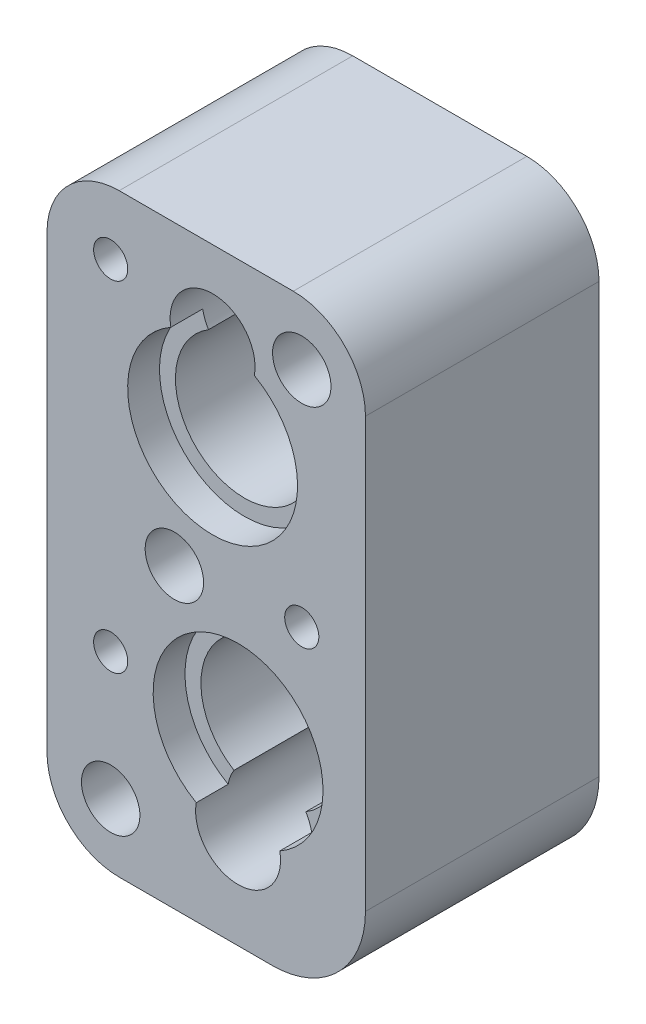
ISO-10303-21;
HEADER;
FILE_DESCRIPTION(('STEP AP214'),'2;1');
FILE_NAME('part.step','',(''),(''),'','','');
FILE_SCHEMA(('AUTOMOTIVE_DESIGN { 1 0 10303 214 1 1 1 1 }'));
ENDSEC;
DATA;
#1=APPLICATION_CONTEXT('core data for automotive mechanical design processes');
#2=APPLICATION_PROTOCOL_DEFINITION('international standard','automotive_design',2000,#1);
#3=PRODUCT_CONTEXT('',#1,'mechanical');
#4=PRODUCT('Part','Part','',(#3));
#5=PRODUCT_RELATED_PRODUCT_CATEGORY('part','',(#4));
#6=PRODUCT_DEFINITION_FORMATION('','',#4);
#7=PRODUCT_DEFINITION_CONTEXT('part definition',#1,'design');
#8=PRODUCT_DEFINITION('design','',#6,#7);
#9=PRODUCT_DEFINITION_SHAPE('','',#8);
#10=(LENGTH_UNIT() NAMED_UNIT(*) SI_UNIT(.MILLI.,.METRE.));
#11=(NAMED_UNIT(*) PLANE_ANGLE_UNIT() SI_UNIT($,.RADIAN.));
#12=(NAMED_UNIT(*) SI_UNIT($,.STERADIAN.) SOLID_ANGLE_UNIT());
#13=UNCERTAINTY_MEASURE_WITH_UNIT(LENGTH_MEASURE(1.E-05),#10,'distance_accuracy_value','');
#14=(GEOMETRIC_REPRESENTATION_CONTEXT(3) GLOBAL_UNCERTAINTY_ASSIGNED_CONTEXT((#13)) GLOBAL_UNIT_ASSIGNED_CONTEXT((#10,
#11,#12)) REPRESENTATION_CONTEXT('',''));
#15=CARTESIAN_POINT('',(0.,0.,0.));
#16=DIRECTION('',(0.,0.,1.));
#17=DIRECTION('',(1.,0.,0.));
#18=AXIS2_PLACEMENT_3D('',#15,#16,#17);
#19=CARTESIAN_POINT('',(-147.955,77.8002,37.0332));
#20=DIRECTION('',(0.,0.,1.));
#21=DIRECTION('',(0.,-1.,0.));
#22=AXIS2_PLACEMENT_3D('',#19,#20,#21);
#23=CYLINDRICAL_SURFACE('',#22,10.795);
#24=DIRECTION('',(0.,0.,1.));
#25=VECTOR('',#24,1.);
#26=CARTESIAN_POINT('',(-158.75,77.8002,37.0332));
#27=LINE('',#26,#25);
#28=CARTESIAN_POINT('',(-158.75,77.8002,37.0332));
#29=VERTEX_POINT('',#28);
#30=CARTESIAN_POINT('',(-158.75,77.8002,71.9582));
#31=VERTEX_POINT('',#30);
#32=EDGE_CURVE('E443',#29,#31,#27,.T.);
#33=ORIENTED_EDGE('',*,*,#32,.T.);
#34=CARTESIAN_POINT('',(-147.955,77.8002,71.9582));
#35=DIRECTION('',(0.,0.,-1.));
#36=DIRECTION('',(0.,-1.,0.));
#37=AXIS2_PLACEMENT_3D('',#34,#35,#36);
#38=CIRCLE('',#37,10.795);
#39=CARTESIAN_POINT('',(-147.955,88.5952,71.9582));
#40=VERTEX_POINT('',#39);
#41=EDGE_CURVE('E190',#31,#40,#38,.T.);
#42=ORIENTED_EDGE('',*,*,#41,.T.);
#43=DIRECTION('',(0.,0.,1.));
#44=VECTOR('',#43,1.);
#45=CARTESIAN_POINT('',(-147.955,88.5952,37.0332));
#46=LINE('',#45,#44);
#47=CARTESIAN_POINT('',(-147.955,88.5952,37.0332));
#48=VERTEX_POINT('',#47);
#49=EDGE_CURVE('E507',#48,#40,#46,.T.);
#50=ORIENTED_EDGE('',*,*,#49,.F.);
#51=CARTESIAN_POINT('',(-147.955,77.8002,37.0332));
#52=DIRECTION('',(0.,0.,-1.));
#53=DIRECTION('',(0.,-1.,0.));
#54=AXIS2_PLACEMENT_3D('',#51,#52,#53);
#55=CIRCLE('',#54,10.795);
#56=EDGE_CURVE('E449',#29,#48,#55,.T.);
#57=ORIENTED_EDGE('',*,*,#56,.F.);
#58=EDGE_LOOP('',(#33,#42,#50,#57));
#59=FACE_BOUND('',#58,.T.);
#60=ADVANCED_FACE('F54',(#59),#23,.T.);
#61=CARTESIAN_POINT('',(-121.92,88.5952,37.0332));
#62=DIRECTION('',(0.,-1.,0.));
#63=DIRECTION('',(0.,0.,-1.));
#64=AXIS2_PLACEMENT_3D('',#61,#62,#63);
#65=PLANE('',#64);
#66=ORIENTED_EDGE('',*,*,#49,.T.);
#67=DIRECTION('',(1.,0.,0.));
#68=VECTOR('',#67,1.);
#69=CARTESIAN_POINT('',(-121.92,88.5952,71.9582));
#70=LINE('',#69,#68);
#71=CARTESIAN_POINT('',(-121.92,88.5952,71.9582));
#72=VERTEX_POINT('',#71);
#73=EDGE_CURVE('E197',#40,#72,#70,.T.);
#74=ORIENTED_EDGE('',*,*,#73,.T.);
#75=DIRECTION('',(0.,0.,1.));
#76=VECTOR('',#75,1.);
#77=CARTESIAN_POINT('',(-121.92,88.5952,37.0332));
#78=LINE('',#77,#76);
#79=CARTESIAN_POINT('',(-121.92,88.5952,37.0332));
#80=VERTEX_POINT('',#79);
#81=EDGE_CURVE('E503',#80,#72,#78,.T.);
#82=ORIENTED_EDGE('',*,*,#81,.F.);
#83=DIRECTION('',(1.,0.,0.));
#84=VECTOR('',#83,1.);
#85=CARTESIAN_POINT('',(-121.92,88.5952,37.0332));
#86=LINE('',#85,#84);
#87=EDGE_CURVE('E456',#48,#80,#86,.T.);
#88=ORIENTED_EDGE('',*,*,#87,.F.);
#89=EDGE_LOOP('',(#66,#74,#82,#88));
#90=FACE_BOUND('',#89,.T.);
#91=ADVANCED_FACE('F537',(#90),#65,.F.);
#92=CARTESIAN_POINT('',(-121.92,77.8002,37.0332));
#93=DIRECTION('',(0.,0.,1.));
#94=DIRECTION('',(0.,-1.,0.));
#95=AXIS2_PLACEMENT_3D('',#92,#93,#94);
#96=CYLINDRICAL_SURFACE('',#95,10.795);
#97=ORIENTED_EDGE('',*,*,#81,.T.);
#98=CARTESIAN_POINT('',(-121.92,77.8002,71.9582));
#99=DIRECTION('',(0.,0.,-1.));
#100=DIRECTION('',(0.,1.,0.));
#101=AXIS2_PLACEMENT_3D('',#98,#99,#100);
#102=CIRCLE('',#101,10.795);
#103=CARTESIAN_POINT('',(-111.125,77.8002,71.9582));
#104=VERTEX_POINT('',#103);
#105=EDGE_CURVE('E476',#72,#104,#102,.T.);
#106=ORIENTED_EDGE('',*,*,#105,.T.);
#107=DIRECTION('',(0.,0.,1.));
#108=VECTOR('',#107,1.);
#109=CARTESIAN_POINT('',(-111.125,77.8002,37.0332));
#110=LINE('',#109,#108);
#111=CARTESIAN_POINT('',(-111.125,77.8002,37.0332));
#112=VERTEX_POINT('',#111);
#113=EDGE_CURVE('E500',#112,#104,#110,.T.);
#114=ORIENTED_EDGE('',*,*,#113,.F.);
#115=CARTESIAN_POINT('',(-121.92,77.8002,37.0332));
#116=DIRECTION('',(0.,0.,-1.));
#117=DIRECTION('',(0.,1.,0.));
#118=AXIS2_PLACEMENT_3D('',#115,#116,#117);
#119=CIRCLE('',#118,10.795);
#120=EDGE_CURVE('E529',#80,#112,#119,.T.);
#121=ORIENTED_EDGE('',*,*,#120,.F.);
#122=EDGE_LOOP('',(#97,#106,#114,#121));
#123=FACE_BOUND('',#122,.T.);
#124=ADVANCED_FACE('F540',(#123),#96,.T.);
#125=CARTESIAN_POINT('',(-111.125,77.8002,37.0332));
#126=DIRECTION('',(-1.,0.,0.));
#127=DIRECTION('',(0.,-1.,0.));
#128=AXIS2_PLACEMENT_3D('',#125,#126,#127);
#129=PLANE('',#128);
#130=ORIENTED_EDGE('',*,*,#113,.T.);
#131=DIRECTION('',(0.,-1.,0.));
#132=VECTOR('',#131,1.);
#133=CARTESIAN_POINT('',(-111.125,77.8002,71.9582));
#134=LINE('',#133,#132);
#135=CARTESIAN_POINT('',(-111.125,13.6652,71.9582));
#136=VERTEX_POINT('',#135);
#137=EDGE_CURVE('E469',#104,#136,#134,.T.);
#138=ORIENTED_EDGE('',*,*,#137,.T.);
#139=DIRECTION('',(0.,0.,1.));
#140=VECTOR('',#139,1.);
#141=CARTESIAN_POINT('',(-111.125,13.6652,37.0332));
#142=LINE('',#141,#140);
#143=CARTESIAN_POINT('',(-111.125,13.6652,37.0332));
#144=VERTEX_POINT('',#143);
#145=EDGE_CURVE('E496',#144,#136,#142,.T.);
#146=ORIENTED_EDGE('',*,*,#145,.F.);
#147=DIRECTION('',(0.,-1.,0.));
#148=VECTOR('',#147,1.);
#149=CARTESIAN_POINT('',(-111.125,77.8002,37.0332));
#150=LINE('',#149,#148);
#151=EDGE_CURVE('E526',#112,#144,#150,.T.);
#152=ORIENTED_EDGE('',*,*,#151,.F.);
#153=EDGE_LOOP('',(#130,#138,#146,#152));
#154=FACE_BOUND('',#153,.T.);
#155=ADVANCED_FACE('F545',(#154),#129,.F.);
#156=CARTESIAN_POINT('',(-125.095,13.6652,37.0332));
#157=DIRECTION('',(0.,0.,1.));
#158=DIRECTION('',(0.,-1.,0.));
#159=AXIS2_PLACEMENT_3D('',#156,#157,#158);
#160=CYLINDRICAL_SURFACE('',#159,13.97);
#161=ORIENTED_EDGE('',*,*,#145,.T.);
#162=CARTESIAN_POINT('',(-125.095,13.6652,71.9582));
#163=DIRECTION('',(0.,0.,-1.));
#164=DIRECTION('',(0.,1.,0.));
#165=AXIS2_PLACEMENT_3D('',#162,#163,#164);
#166=CIRCLE('',#165,13.97);
#167=CARTESIAN_POINT('',(-125.095,-0.304799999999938,71.9582));
#168=VERTEX_POINT('',#167);
#169=EDGE_CURVE('E475',#136,#168,#166,.T.);
#170=ORIENTED_EDGE('',*,*,#169,.T.);
#171=DIRECTION('',(0.,0.,1.));
#172=VECTOR('',#171,1.);
#173=CARTESIAN_POINT('',(-125.095,-0.304799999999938,37.0332));
#174=LINE('',#173,#172);
#175=CARTESIAN_POINT('',(-125.095,-0.304799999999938,37.0332));
#176=VERTEX_POINT('',#175);
#177=EDGE_CURVE('E493',#176,#168,#174,.T.);
#178=ORIENTED_EDGE('',*,*,#177,.F.);
#179=CARTESIAN_POINT('',(-125.095,13.6652,37.0332));
#180=DIRECTION('',(0.,0.,-1.));
#181=DIRECTION('',(0.,1.,0.));
#182=AXIS2_PLACEMENT_3D('',#179,#180,#181);
#183=CIRCLE('',#182,13.97);
#184=EDGE_CURVE('E523',#144,#176,#183,.T.);
#185=ORIENTED_EDGE('',*,*,#184,.F.);
#186=EDGE_LOOP('',(#161,#170,#178,#185));
#187=FACE_BOUND('',#186,.T.);
#188=ADVANCED_FACE('F551',(#187),#160,.T.);
#189=CARTESIAN_POINT('',(-125.095,-0.304799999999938,37.0332));
#190=DIRECTION('',(0.,1.,0.));
#191=DIRECTION('',(0.,0.,1.));
#192=AXIS2_PLACEMENT_3D('',#189,#190,#191);
#193=PLANE('',#192);
#194=ORIENTED_EDGE('',*,*,#177,.T.);
#195=DIRECTION('',(-1.,0.,0.));
#196=VECTOR('',#195,1.);
#197=CARTESIAN_POINT('',(-125.095,-0.304799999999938,71.9582));
#198=LINE('',#197,#196);
#199=CARTESIAN_POINT('',(-147.955,-0.304799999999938,71.9582));
#200=VERTEX_POINT('',#199);
#201=EDGE_CURVE('E458',#168,#200,#198,.T.);
#202=ORIENTED_EDGE('',*,*,#201,.T.);
#203=DIRECTION('',(0.,0.,1.));
#204=VECTOR('',#203,1.);
#205=CARTESIAN_POINT('',(-147.955,-0.304799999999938,37.0332));
#206=LINE('',#205,#204);
#207=CARTESIAN_POINT('',(-147.955,-0.304799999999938,37.0332));
#208=VERTEX_POINT('',#207);
#209=EDGE_CURVE('E488',#208,#200,#206,.T.);
#210=ORIENTED_EDGE('',*,*,#209,.F.);
#211=DIRECTION('',(-1.,0.,0.));
#212=VECTOR('',#211,1.);
#213=CARTESIAN_POINT('',(-125.095,-0.304799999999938,37.0332));
#214=LINE('',#213,#212);
#215=EDGE_CURVE('E520',#176,#208,#214,.T.);
#216=ORIENTED_EDGE('',*,*,#215,.F.);
#217=EDGE_LOOP('',(#194,#202,#210,#216));
#218=FACE_BOUND('',#217,.T.);
#219=ADVANCED_FACE('F556',(#218),#193,.F.);
#220=CARTESIAN_POINT('',(-147.955,10.4902000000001,37.0332));
#221=DIRECTION('',(0.,0.,1.));
#222=DIRECTION('',(0.,-1.,0.));
#223=AXIS2_PLACEMENT_3D('',#220,#221,#222);
#224=CYLINDRICAL_SURFACE('',#223,10.795);
#225=ORIENTED_EDGE('',*,*,#209,.T.);
#226=CARTESIAN_POINT('',(-147.955,10.4902000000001,71.9582));
#227=DIRECTION('',(0.,0.,-1.));
#228=DIRECTION('',(0.,1.,0.));
#229=AXIS2_PLACEMENT_3D('',#226,#227,#228);
#230=CIRCLE('',#229,10.795);
#231=CARTESIAN_POINT('',(-158.75,10.4902000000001,71.9582));
#232=VERTEX_POINT('',#231);
#233=EDGE_CURVE('E450',#200,#232,#230,.T.);
#234=ORIENTED_EDGE('',*,*,#233,.T.);
#235=DIRECTION('',(0.,0.,1.));
#236=VECTOR('',#235,1.);
#237=CARTESIAN_POINT('',(-158.75,10.4902000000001,37.0332));
#238=LINE('',#237,#236);
#239=CARTESIAN_POINT('',(-158.75,10.4902000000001,37.0332));
#240=VERTEX_POINT('',#239);
#241=EDGE_CURVE('E446',#240,#232,#238,.T.);
#242=ORIENTED_EDGE('',*,*,#241,.F.);
#243=CARTESIAN_POINT('',(-147.955,10.4902000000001,37.0332));
#244=DIRECTION('',(0.,0.,-1.));
#245=DIRECTION('',(0.,1.,0.));
#246=AXIS2_PLACEMENT_3D('',#243,#244,#245);
#247=CIRCLE('',#246,10.795);
#248=EDGE_CURVE('E517',#208,#240,#247,.T.);
#249=ORIENTED_EDGE('',*,*,#248,.F.);
#250=EDGE_LOOP('',(#225,#234,#242,#249));
#251=FACE_BOUND('',#250,.T.);
#252=ADVANCED_FACE('F559',(#251),#224,.T.);
#253=CARTESIAN_POINT('',(-158.75,77.8002,37.0332));
#254=DIRECTION('',(1.,0.,0.));
#255=DIRECTION('',(0.,0.,-1.));
#256=AXIS2_PLACEMENT_3D('',#253,#254,#255);
#257=PLANE('',#256);
#258=ORIENTED_EDGE('',*,*,#241,.T.);
#259=DIRECTION('',(0.,1.,0.));
#260=VECTOR('',#259,1.);
#261=CARTESIAN_POINT('',(-158.75,77.8002,71.9582));
#262=LINE('',#261,#260);
#263=EDGE_CURVE('E434',#232,#31,#262,.T.);
#264=ORIENTED_EDGE('',*,*,#263,.T.);
#265=ORIENTED_EDGE('',*,*,#32,.F.);
#266=DIRECTION('',(0.,1.,0.));
#267=VECTOR('',#266,1.);
#268=CARTESIAN_POINT('',(-158.75,77.8002,37.0332));
#269=LINE('',#268,#267);
#270=EDGE_CURVE('E514',#240,#29,#269,.T.);
#271=ORIENTED_EDGE('',*,*,#270,.F.);
#272=EDGE_LOOP('',(#258,#264,#265,#271));
#273=FACE_BOUND('',#272,.T.);
#274=ADVANCED_FACE('F441',(#273),#257,.F.);
#275=CARTESIAN_POINT('',(-147.955,77.8002,37.0332));
#276=DIRECTION('',(0.,0.,1.));
#277=DIRECTION('',(0.,-1.,0.));
#278=AXIS2_PLACEMENT_3D('',#275,#276,#277);
#279=PLANE('',#278);
#280=CARTESIAN_POINT('',(-120.65,79.0702,37.0332));
#281=DIRECTION('',(0.,0.,-1.));
#282=DIRECTION('',(0.,1.,0.));
#283=AXIS2_PLACEMENT_3D('',#280,#281,#282);
#284=CIRCLE('',#283,6.54050000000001);
#285=CARTESIAN_POINT('',(-120.65,85.6107,37.0332));
#286=VERTEX_POINT('',#285);
#287=EDGE_CURVE('E332',#286,#286,#284,.T.);
#288=ORIENTED_EDGE('',*,*,#287,.F.);
#289=EDGE_LOOP('',(#288));
#290=FACE_BOUND('',#289,.T.);
#291=CARTESIAN_POINT('',(-139.7,44.1452000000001,37.0332));
#292=DIRECTION('',(0.,0.,-1.));
#293=DIRECTION('',(0.,1.,0.));
#294=AXIS2_PLACEMENT_3D('',#291,#292,#293);
#295=CIRCLE('',#294,6.54050000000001);
#296=CARTESIAN_POINT('',(-139.7,50.6857000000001,37.0332));
#297=VERTEX_POINT('',#296);
#298=EDGE_CURVE('E371',#297,#297,#295,.T.);
#299=ORIENTED_EDGE('',*,*,#298,.F.);
#300=EDGE_LOOP('',(#299));
#301=FACE_BOUND('',#300,.T.);
#302=CARTESIAN_POINT('',(-149.225,9.22020000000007,37.0332));
#303=DIRECTION('',(0.,0.,-1.));
#304=DIRECTION('',(0.,1.,0.));
#305=AXIS2_PLACEMENT_3D('',#302,#303,#304);
#306=CIRCLE('',#305,6.54050000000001);
#307=CARTESIAN_POINT('',(-149.225,15.7607000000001,37.0332));
#308=VERTEX_POINT('',#307);
#309=EDGE_CURVE('E390',#308,#308,#306,.T.);
#310=ORIENTED_EDGE('',*,*,#309,.F.);
#311=EDGE_LOOP('',(#310));
#312=FACE_BOUND('',#311,.T.);
#313=CARTESIAN_POINT('',(-149.225,28.2702000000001,37.0331999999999));
#314=DIRECTION('',(0.,0.,1.));
#315=DIRECTION('',(1.,0.,0.));
#316=AXIS2_PLACEMENT_3D('',#313,#314,#315);
#317=CIRCLE('',#316,2.55269999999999);
#318=CARTESIAN_POINT('',(-146.6723,28.2702000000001,37.0331999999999));
#319=VERTEX_POINT('',#318);
#320=EDGE_CURVE('E315',#319,#319,#317,.T.);
#321=ORIENTED_EDGE('',*,*,#320,.T.);
#322=EDGE_LOOP('',(#321));
#323=FACE_BOUND('',#322,.T.);
#324=CARTESIAN_POINT('',(-120.65,45.7327,37.0331999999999));
#325=DIRECTION('',(0.,0.,1.));
#326=DIRECTION('',(1.,0.,0.));
#327=AXIS2_PLACEMENT_3D('',#324,#325,#326);
#328=CIRCLE('',#327,2.55269999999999);
#329=CARTESIAN_POINT('',(-118.0973,45.7327,37.0331999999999));
#330=VERTEX_POINT('',#329);
#331=EDGE_CURVE('E300',#330,#330,#328,.T.);
#332=ORIENTED_EDGE('',*,*,#331,.T.);
#333=EDGE_LOOP('',(#332));
#334=FACE_BOUND('',#333,.T.);
#335=CARTESIAN_POINT('',(-149.225,79.0702,37.0331999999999));
#336=DIRECTION('',(0.,0.,1.));
#337=DIRECTION('',(1.,0.,0.));
#338=AXIS2_PLACEMENT_3D('',#335,#336,#337);
#339=CIRCLE('',#338,2.55269999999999);
#340=CARTESIAN_POINT('',(-146.6723,79.0702,37.0331999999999));
#341=VERTEX_POINT('',#340);
#342=EDGE_CURVE('E267',#341,#341,#339,.T.);
#343=ORIENTED_EDGE('',*,*,#342,.T.);
#344=EDGE_LOOP('',(#343));
#345=FACE_BOUND('',#344,.T.);
#346=CARTESIAN_POINT('',(-133.985,75.8952,37.0332));
#347=DIRECTION('',(0.,0.,-1.));
#348=DIRECTION('',(0.,1.,0.));
#349=AXIS2_PLACEMENT_3D('',#346,#347,#348);
#350=CIRCLE('',#349,6.34999999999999);
#351=CARTESIAN_POINT('',(-139.35881585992,72.5122126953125,37.0332));
#352=VERTEX_POINT('',#351);
#353=CARTESIAN_POINT('',(-128.61118414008,72.5122126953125,37.0332));
#354=VERTEX_POINT('',#353);
#355=EDGE_CURVE('E200',#352,#354,#350,.T.);
#356=ORIENTED_EDGE('',*,*,#355,.F.);
#357=CARTESIAN_POINT('',(-133.985,63.7032,37.0332));
#358=DIRECTION('',(0.,0.,1.));
#359=DIRECTION('',(1.,0.,0.));
#360=AXIS2_PLACEMENT_3D('',#357,#358,#359);
#361=CIRCLE('',#360,10.31875);
#362=EDGE_CURVE('E175',#352,#354,#361,.T.);
#363=ORIENTED_EDGE('',*,*,#362,.T.);
#364=EDGE_LOOP('',(#356,#363));
#365=FACE_BOUND('',#364,.T.);
#366=CARTESIAN_POINT('',(-130.175,13.97,37.0332));
#367=DIRECTION('',(0.,0.,-1.));
#368=DIRECTION('',(0.,1.,0.));
#369=AXIS2_PLACEMENT_3D('',#366,#367,#368);
#370=CIRCLE('',#369,6.34999999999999);
#371=CARTESIAN_POINT('',(-124.80118414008,17.3529873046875,37.0331999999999));
#372=VERTEX_POINT('',#371);
#373=CARTESIAN_POINT('',(-135.54881585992,17.3529873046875,37.0331999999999));
#374=VERTEX_POINT('',#373);
#375=EDGE_CURVE('E181',#372,#374,#370,.T.);
#376=ORIENTED_EDGE('',*,*,#375,.F.);
#377=CARTESIAN_POINT('',(-130.175,26.162,37.0331999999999));
#378=DIRECTION('',(0.,0.,1.));
#379=DIRECTION('',(1.,0.,0.));
#380=AXIS2_PLACEMENT_3D('',#377,#378,#379);
#381=CIRCLE('',#380,10.31875);
#382=EDGE_CURVE('E168',#372,#374,#381,.T.);
#383=ORIENTED_EDGE('',*,*,#382,.T.);
#384=EDGE_LOOP('',(#376,#383));
#385=FACE_BOUND('',#384,.T.);
#386=ORIENTED_EDGE('',*,*,#56,.T.);
#387=ORIENTED_EDGE('',*,*,#87,.T.);
#388=ORIENTED_EDGE('',*,*,#120,.T.);
#389=ORIENTED_EDGE('',*,*,#151,.T.);
#390=ORIENTED_EDGE('',*,*,#184,.T.);
#391=ORIENTED_EDGE('',*,*,#215,.T.);
#392=ORIENTED_EDGE('',*,*,#248,.T.);
#393=ORIENTED_EDGE('',*,*,#270,.T.);
#394=EDGE_LOOP('',(#386,#387,#388,#389,#390,#391,#392,#393));
#395=FACE_BOUND('',#394,.T.);
#396=ADVANCED_FACE('F179',(#290,#301,#312,#323,#334,#345,#365,#385,#395),#279,.F.);
#397=CARTESIAN_POINT('',(-147.955,77.8002,71.9582));
#398=DIRECTION('',(0.,0.,1.));
#399=DIRECTION('',(0.,-1.,0.));
#400=AXIS2_PLACEMENT_3D('',#397,#398,#399);
#401=PLANE('',#400);
#402=CARTESIAN_POINT('',(-120.65,79.0702,71.9582));
#403=DIRECTION('',(0.,0.,-1.));
#404=DIRECTION('',(0.,1.,0.));
#405=AXIS2_PLACEMENT_3D('',#402,#403,#404);
#406=CIRCLE('',#405,4.36879999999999);
#407=CARTESIAN_POINT('',(-120.65,83.439,71.9582));
#408=VERTEX_POINT('',#407);
#409=EDGE_CURVE('E750',#408,#408,#406,.T.);
#410=ORIENTED_EDGE('',*,*,#409,.T.);
#411=EDGE_LOOP('',(#410));
#412=FACE_BOUND('',#411,.T.);
#413=CARTESIAN_POINT('',(-139.7,44.1452000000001,71.9582));
#414=DIRECTION('',(0.,0.,-1.));
#415=DIRECTION('',(0.,1.,0.));
#416=AXIS2_PLACEMENT_3D('',#413,#414,#415);
#417=CIRCLE('',#416,4.36879999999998);
#418=CARTESIAN_POINT('',(-139.7,48.514,71.9582));
#419=VERTEX_POINT('',#418);
#420=EDGE_CURVE('E325',#419,#419,#417,.T.);
#421=ORIENTED_EDGE('',*,*,#420,.T.);
#422=EDGE_LOOP('',(#421));
#423=FACE_BOUND('',#422,.T.);
#424=CARTESIAN_POINT('',(-149.225,9.22020000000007,71.9582));
#425=DIRECTION('',(0.,0.,-1.));
#426=DIRECTION('',(0.,1.,0.));
#427=AXIS2_PLACEMENT_3D('',#424,#425,#426);
#428=CIRCLE('',#427,4.36879999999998);
#429=CARTESIAN_POINT('',(-149.225,13.589,71.9582));
#430=VERTEX_POINT('',#429);
#431=EDGE_CURVE('E365',#430,#430,#428,.T.);
#432=ORIENTED_EDGE('',*,*,#431,.T.);
#433=EDGE_LOOP('',(#432));
#434=FACE_BOUND('',#433,.T.);
#435=CARTESIAN_POINT('',(-149.225,28.2702000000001,71.9582));
#436=DIRECTION('',(0.,0.,1.));
#437=DIRECTION('',(1.,0.,0.));
#438=AXIS2_PLACEMENT_3D('',#435,#436,#437);
#439=CIRCLE('',#438,2.55269999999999);
#440=CARTESIAN_POINT('',(-146.6723,28.2702000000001,71.9582));
#441=VERTEX_POINT('',#440);
#442=EDGE_CURVE('E310',#441,#441,#439,.T.);
#443=ORIENTED_EDGE('',*,*,#442,.F.);
#444=EDGE_LOOP('',(#443));
#445=FACE_BOUND('',#444,.T.);
#446=CARTESIAN_POINT('',(-120.65,45.7327,71.9582));
#447=DIRECTION('',(0.,0.,1.));
#448=DIRECTION('',(1.,0.,0.));
#449=AXIS2_PLACEMENT_3D('',#446,#447,#448);
#450=CIRCLE('',#449,2.55270000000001);
#451=CARTESIAN_POINT('',(-118.0973,45.7327,71.9582));
#452=VERTEX_POINT('',#451);
#453=EDGE_CURVE('E295',#452,#452,#450,.T.);
#454=ORIENTED_EDGE('',*,*,#453,.F.);
#455=EDGE_LOOP('',(#454));
#456=FACE_BOUND('',#455,.T.);
#457=CARTESIAN_POINT('',(-149.225,79.0702,71.9582));
#458=DIRECTION('',(0.,0.,1.));
#459=DIRECTION('',(1.,0.,0.));
#460=AXIS2_PLACEMENT_3D('',#457,#458,#459);
#461=CIRCLE('',#460,2.55269999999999);
#462=CARTESIAN_POINT('',(-146.6723,79.0702,71.9582));
#463=VERTEX_POINT('',#462);
#464=EDGE_CURVE('E183',#463,#463,#461,.T.);
#465=ORIENTED_EDGE('',*,*,#464,.F.);
#466=EDGE_LOOP('',(#465));
#467=FACE_BOUND('',#466,.T.);
#468=CARTESIAN_POINT('',(-130.175,26.162,71.9582));
#469=DIRECTION('',(0.,0.,1.));
#470=DIRECTION('',(0.,-1.,0.));
#471=AXIS2_PLACEMENT_3D('',#468,#469,#470);
#472=CIRCLE('',#471,12.7);
#473=CARTESIAN_POINT('',(-123.927269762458,15.1050625,71.9582));
#474=VERTEX_POINT('',#473);
#475=CARTESIAN_POINT('',(-136.422730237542,15.1050625,71.9582));
#476=VERTEX_POINT('',#475);
#477=EDGE_CURVE('E12',#474,#476,#472,.T.);
#478=ORIENTED_EDGE('',*,*,#477,.F.);
#479=CARTESIAN_POINT('',(-130.175,13.97,71.9582));
#480=DIRECTION('',(0.,0.,-1.));
#481=DIRECTION('',(0.,1.,0.));
#482=AXIS2_PLACEMENT_3D('',#479,#480,#481);
#483=CIRCLE('',#482,6.34999999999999);
#484=EDGE_CURVE('E191',#474,#476,#483,.T.);
#485=ORIENTED_EDGE('',*,*,#484,.T.);
#486=EDGE_LOOP('',(#478,#485));
#487=FACE_BOUND('',#486,.T.);
#488=CARTESIAN_POINT('',(-133.985,63.7032,71.9582));
#489=DIRECTION('',(0.,0.,1.));
#490=DIRECTION('',(1.,0.,0.));
#491=AXIS2_PLACEMENT_3D('',#488,#489,#490);
#492=CIRCLE('',#491,12.7);
#493=CARTESIAN_POINT('',(-140.232730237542,74.7601375,71.9582));
#494=VERTEX_POINT('',#493);
#495=CARTESIAN_POINT('',(-127.737269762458,74.7601375,71.9582));
#496=VERTEX_POINT('',#495);
#497=EDGE_CURVE('E78',#494,#496,#492,.T.);
#498=ORIENTED_EDGE('',*,*,#497,.F.);
#499=CARTESIAN_POINT('',(-133.985,75.8952,71.9582));
#500=DIRECTION('',(0.,0.,-1.));
#501=DIRECTION('',(0.,1.,0.));
#502=AXIS2_PLACEMENT_3D('',#499,#500,#501);
#503=CIRCLE('',#502,6.34999999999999);
#504=EDGE_CURVE('E614',#494,#496,#503,.T.);
#505=ORIENTED_EDGE('',*,*,#504,.T.);
#506=EDGE_LOOP('',(#498,#505));
#507=FACE_BOUND('',#506,.T.);
#508=ORIENTED_EDGE('',*,*,#41,.F.);
#509=ORIENTED_EDGE('',*,*,#263,.F.);
#510=ORIENTED_EDGE('',*,*,#233,.F.);
#511=ORIENTED_EDGE('',*,*,#201,.F.);
#512=ORIENTED_EDGE('',*,*,#169,.F.);
#513=ORIENTED_EDGE('',*,*,#137,.F.);
#514=ORIENTED_EDGE('',*,*,#105,.F.);
#515=ORIENTED_EDGE('',*,*,#73,.F.);
#516=EDGE_LOOP('',(#508,#509,#510,#511,#512,#513,#514,#515));
#517=FACE_BOUND('',#516,.T.);
#518=ADVANCED_FACE('F416',(#412,#423,#434,#445,#456,#467,#487,#507,#517),#401,.T.);
#519=CARTESIAN_POINT('',(-130.175,13.97,37.0332));
#520=DIRECTION('',(0.,0.,-1.));
#521=DIRECTION('',(0.,1.,0.));
#522=AXIS2_PLACEMENT_3D('',#519,#520,#521);
#523=CYLINDRICAL_SURFACE('',#522,6.34999999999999);
#524=ORIENTED_EDGE('',*,*,#484,.F.);
#525=DIRECTION('',(0.,0.,1.));
#526=VECTOR('',#525,1.);
#527=CARTESIAN_POINT('',(-123.927269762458,15.1050625,69.57695));
#528=LINE('',#527,#526);
#529=CARTESIAN_POINT('',(-123.927269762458,15.1050625,67.1957));
#530=VERTEX_POINT('',#529);
#531=EDGE_CURVE('E63',#474,#530,#528,.F.);
#532=ORIENTED_EDGE('',*,*,#531,.T.);
#533=CARTESIAN_POINT('',(-130.175,13.97,67.1957));
#534=DIRECTION('',(0.,0.,-1.));
#535=DIRECTION('',(-1.,0.,0.));
#536=AXIS2_PLACEMENT_3D('',#533,#534,#535);
#537=CIRCLE('',#536,6.34999999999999);
#538=CARTESIAN_POINT('',(-124.80118414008,17.3529873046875,67.1957));
#539=VERTEX_POINT('',#538);
#540=EDGE_CURVE('E221',#530,#539,#537,.F.);
#541=ORIENTED_EDGE('',*,*,#540,.T.);
#542=DIRECTION('',(0.,0.,1.));
#543=VECTOR('',#542,1.);
#544=CARTESIAN_POINT('',(-124.80118414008,17.3529873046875,52.11445));
#545=LINE('',#544,#543);
#546=EDGE_CURVE('E188',#539,#372,#545,.F.);
#547=ORIENTED_EDGE('',*,*,#546,.T.);
#548=ORIENTED_EDGE('',*,*,#375,.T.);
#549=DIRECTION('',(0.,0.,1.));
#550=VECTOR('',#549,1.);
#551=CARTESIAN_POINT('',(-135.54881585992,17.3529873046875,52.11445));
#552=LINE('',#551,#550);
#553=CARTESIAN_POINT('',(-135.54881585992,17.3529873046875,67.1957));
#554=VERTEX_POINT('',#553);
#555=EDGE_CURVE('E165',#374,#554,#552,.T.);
#556=ORIENTED_EDGE('',*,*,#555,.T.);
#557=CARTESIAN_POINT('',(-136.422730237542,15.1050625,67.1957));
#558=VERTEX_POINT('',#557);
#559=EDGE_CURVE('E174',#554,#558,#537,.F.);
#560=ORIENTED_EDGE('',*,*,#559,.T.);
#561=DIRECTION('',(0.,0.,1.));
#562=VECTOR('',#561,1.);
#563=CARTESIAN_POINT('',(-136.422730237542,15.1050625,69.57695));
#564=LINE('',#563,#562);
#565=EDGE_CURVE('E220',#558,#476,#564,.T.);
#566=ORIENTED_EDGE('',*,*,#565,.T.);
#567=EDGE_LOOP('',(#524,#532,#541,#547,#548,#556,#560,#566));
#568=FACE_BOUND('',#567,.T.);
#569=ADVANCED_FACE('F186',(#568),#523,.F.);
#570=CARTESIAN_POINT('',(-133.985,75.8952,37.0332));
#571=DIRECTION('',(0.,0.,-1.));
#572=DIRECTION('',(0.,1.,0.));
#573=AXIS2_PLACEMENT_3D('',#570,#571,#572);
#574=CYLINDRICAL_SURFACE('',#573,6.34999999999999);
#575=CARTESIAN_POINT('',(-133.985,75.8952,67.1957));
#576=DIRECTION('',(0.,0.,-1.));
#577=DIRECTION('',(-1.,0.,0.));
#578=AXIS2_PLACEMENT_3D('',#575,#576,#577);
#579=CIRCLE('',#578,6.34999999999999);
#580=CARTESIAN_POINT('',(-140.232730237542,74.7601375,67.1957));
#581=VERTEX_POINT('',#580);
#582=CARTESIAN_POINT('',(-139.35881585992,72.5122126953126,67.1957));
#583=VERTEX_POINT('',#582);
#584=EDGE_CURVE('E586',#581,#583,#579,.F.);
#585=ORIENTED_EDGE('',*,*,#584,.T.);
#586=DIRECTION('',(0.,0.,1.));
#587=VECTOR('',#586,1.);
#588=CARTESIAN_POINT('',(-139.35881585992,72.5122126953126,52.11445));
#589=LINE('',#588,#587);
#590=EDGE_CURVE('E217',#583,#352,#589,.F.);
#591=ORIENTED_EDGE('',*,*,#590,.T.);
#592=ORIENTED_EDGE('',*,*,#355,.T.);
#593=DIRECTION('',(0.,0.,1.));
#594=VECTOR('',#593,1.);
#595=CARTESIAN_POINT('',(-128.61118414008,72.5122126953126,52.11445));
#596=LINE('',#595,#594);
#597=CARTESIAN_POINT('',(-128.61118414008,72.5122126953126,67.1957));
#598=VERTEX_POINT('',#597);
#599=EDGE_CURVE('E584',#354,#598,#596,.T.);
#600=ORIENTED_EDGE('',*,*,#599,.T.);
#601=CARTESIAN_POINT('',(-127.737269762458,74.7601375,67.1957));
#602=VERTEX_POINT('',#601);
#603=EDGE_CURVE('E580',#598,#602,#579,.F.);
#604=ORIENTED_EDGE('',*,*,#603,.T.);
#605=DIRECTION('',(0.,0.,1.));
#606=VECTOR('',#605,1.);
#607=CARTESIAN_POINT('',(-127.737269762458,74.7601375,69.57695));
#608=LINE('',#607,#606);
#609=EDGE_CURVE('E577',#602,#496,#608,.T.);
#610=ORIENTED_EDGE('',*,*,#609,.T.);
#611=ORIENTED_EDGE('',*,*,#504,.F.);
#612=DIRECTION('',(0.,0.,1.));
#613=VECTOR('',#612,1.);
#614=CARTESIAN_POINT('',(-140.232730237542,74.7601375,69.57695));
#615=LINE('',#614,#613);
#616=EDGE_CURVE('E590',#494,#581,#615,.F.);
#617=ORIENTED_EDGE('',*,*,#616,.T.);
#618=EDGE_LOOP('',(#585,#591,#592,#600,#604,#610,#611,#617));
#619=FACE_BOUND('',#618,.T.);
#620=ADVANCED_FACE('F612',(#619),#574,.F.);
#621=CARTESIAN_POINT('',(-123.66625,63.7032,67.1957));
#622=DIRECTION('',(0.,0.,-1.));
#623=DIRECTION('',(-1.,0.,0.));
#624=AXIS2_PLACEMENT_3D('',#621,#622,#623);
#625=PLANE('',#624);
#626=CARTESIAN_POINT('',(-133.985,63.7032,67.1957));
#627=DIRECTION('',(0.,0.,1.));
#628=DIRECTION('',(1.,0.,0.));
#629=AXIS2_PLACEMENT_3D('',#626,#627,#628);
#630=CIRCLE('',#629,12.7);
#631=EDGE_CURVE('E247',#581,#602,#630,.T.);
#632=ORIENTED_EDGE('',*,*,#631,.T.);
#633=ORIENTED_EDGE('',*,*,#603,.F.);
#634=CARTESIAN_POINT('',(-133.985,63.7032,67.1957));
#635=DIRECTION('',(0.,0.,1.));
#636=DIRECTION('',(1.,0.,0.));
#637=AXIS2_PLACEMENT_3D('',#634,#635,#636);
#638=CIRCLE('',#637,10.31875);
#639=EDGE_CURVE('E241',#583,#598,#638,.T.);
#640=ORIENTED_EDGE('',*,*,#639,.F.);
#641=ORIENTED_EDGE('',*,*,#584,.F.);
#642=EDGE_LOOP('',(#632,#633,#640,#641));
#643=FACE_BOUND('',#642,.T.);
#644=ADVANCED_FACE('F654',(#643),#625,.F.);
#645=CARTESIAN_POINT('',(-133.985,63.7032,71.9582));
#646=DIRECTION('',(0.,0.,1.));
#647=DIRECTION('',(1.,0.,0.));
#648=AXIS2_PLACEMENT_3D('',#645,#646,#647);
#649=CYLINDRICAL_SURFACE('',#648,10.31875);
#650=ORIENTED_EDGE('',*,*,#639,.T.);
#651=ORIENTED_EDGE('',*,*,#599,.F.);
#652=ORIENTED_EDGE('',*,*,#362,.F.);
#653=ORIENTED_EDGE('',*,*,#590,.F.);
#654=EDGE_LOOP('',(#650,#651,#652,#653));
#655=FACE_BOUND('',#654,.T.);
#656=ADVANCED_FACE('F658',(#655),#649,.F.);
#657=CARTESIAN_POINT('',(-133.985,63.7032,71.9582));
#658=DIRECTION('',(0.,0.,1.));
#659=DIRECTION('',(1.,0.,0.));
#660=AXIS2_PLACEMENT_3D('',#657,#658,#659);
#661=CYLINDRICAL_SURFACE('',#660,12.7);
#662=ORIENTED_EDGE('',*,*,#497,.T.);
#663=ORIENTED_EDGE('',*,*,#609,.F.);
#664=ORIENTED_EDGE('',*,*,#631,.F.);
#665=ORIENTED_EDGE('',*,*,#616,.F.);
#666=EDGE_LOOP('',(#662,#663,#664,#665));
#667=FACE_BOUND('',#666,.T.);
#668=ADVANCED_FACE('F656',(#667),#661,.F.);
#669=CARTESIAN_POINT('',(-119.85625,26.162,67.1957));
#670=DIRECTION('',(0.,0.,-1.));
#671=DIRECTION('',(-1.,0.,0.));
#672=AXIS2_PLACEMENT_3D('',#669,#670,#671);
#673=PLANE('',#672);
#674=CARTESIAN_POINT('',(-130.175,26.162,67.1957));
#675=DIRECTION('',(0.,0.,1.));
#676=DIRECTION('',(1.,0.,0.));
#677=AXIS2_PLACEMENT_3D('',#674,#675,#676);
#678=CIRCLE('',#677,12.7);
#679=EDGE_CURVE('E236',#530,#558,#678,.T.);
#680=ORIENTED_EDGE('',*,*,#679,.T.);
#681=ORIENTED_EDGE('',*,*,#559,.F.);
#682=CARTESIAN_POINT('',(-130.175,26.162,67.1957));
#683=DIRECTION('',(0.,0.,1.));
#684=DIRECTION('',(1.,0.,0.));
#685=AXIS2_PLACEMENT_3D('',#682,#683,#684);
#686=CIRCLE('',#685,10.31875);
#687=EDGE_CURVE('E70',#539,#554,#686,.T.);
#688=ORIENTED_EDGE('',*,*,#687,.F.);
#689=ORIENTED_EDGE('',*,*,#540,.F.);
#690=EDGE_LOOP('',(#680,#681,#688,#689));
#691=FACE_BOUND('',#690,.T.);
#692=ADVANCED_FACE('F235',(#691),#673,.F.);
#693=CARTESIAN_POINT('',(-130.175,26.162,71.9582));
#694=DIRECTION('',(0.,0.,1.));
#695=DIRECTION('',(1.,0.,0.));
#696=AXIS2_PLACEMENT_3D('',#693,#694,#695);
#697=CYLINDRICAL_SURFACE('',#696,12.7);
#698=ORIENTED_EDGE('',*,*,#477,.T.);
#699=ORIENTED_EDGE('',*,*,#565,.F.);
#700=ORIENTED_EDGE('',*,*,#679,.F.);
#701=ORIENTED_EDGE('',*,*,#531,.F.);
#702=EDGE_LOOP('',(#698,#699,#700,#701));
#703=FACE_BOUND('',#702,.T.);
#704=ADVANCED_FACE('F238',(#703),#697,.F.);
#705=CARTESIAN_POINT('',(-130.175,26.162,71.9582));
#706=DIRECTION('',(0.,0.,1.));
#707=DIRECTION('',(1.,0.,0.));
#708=AXIS2_PLACEMENT_3D('',#705,#706,#707);
#709=CYLINDRICAL_SURFACE('',#708,10.31875);
#710=ORIENTED_EDGE('',*,*,#687,.T.);
#711=ORIENTED_EDGE('',*,*,#555,.F.);
#712=ORIENTED_EDGE('',*,*,#382,.F.);
#713=ORIENTED_EDGE('',*,*,#546,.F.);
#714=EDGE_LOOP('',(#710,#711,#712,#713));
#715=FACE_BOUND('',#714,.T.);
#716=ADVANCED_FACE('F167',(#715),#709,.F.);
#717=CARTESIAN_POINT('',(-149.225,79.0702,71.9582));
#718=DIRECTION('',(0.,0.,1.));
#719=DIRECTION('',(1.,0.,0.));
#720=AXIS2_PLACEMENT_3D('',#717,#718,#719);
#721=CYLINDRICAL_SURFACE('',#720,2.55269999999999);
#722=ORIENTED_EDGE('',*,*,#342,.F.);
#723=EDGE_LOOP('',(#722));
#724=FACE_BOUND('',#723,.T.);
#725=ORIENTED_EDGE('',*,*,#464,.T.);
#726=EDGE_LOOP('',(#725));
#727=FACE_BOUND('',#726,.T.);
#728=ADVANCED_FACE('F704',(#724,#727),#721,.F.);
#729=CARTESIAN_POINT('',(-120.65,45.7327,71.9582));
#730=DIRECTION('',(0.,0.,1.));
#731=DIRECTION('',(1.,0.,0.));
#732=AXIS2_PLACEMENT_3D('',#729,#730,#731);
#733=CYLINDRICAL_SURFACE('',#732,2.5527);
#734=ORIENTED_EDGE('',*,*,#331,.F.);
#735=EDGE_LOOP('',(#734));
#736=FACE_BOUND('',#735,.T.);
#737=ORIENTED_EDGE('',*,*,#453,.T.);
#738=EDGE_LOOP('',(#737));
#739=FACE_BOUND('',#738,.T.);
#740=ADVANCED_FACE('F412',(#736,#739),#733,.F.);
#741=CARTESIAN_POINT('',(-149.225,28.2702000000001,71.9582));
#742=DIRECTION('',(0.,0.,1.));
#743=DIRECTION('',(1.,0.,0.));
#744=AXIS2_PLACEMENT_3D('',#741,#742,#743);
#745=CYLINDRICAL_SURFACE('',#744,2.55269999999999);
#746=ORIENTED_EDGE('',*,*,#320,.F.);
#747=EDGE_LOOP('',(#746));
#748=FACE_BOUND('',#747,.T.);
#749=ORIENTED_EDGE('',*,*,#442,.T.);
#750=EDGE_LOOP('',(#749));
#751=FACE_BOUND('',#750,.T.);
#752=ADVANCED_FACE('F408',(#748,#751),#745,.F.);
#753=CARTESIAN_POINT('',(-149.225,9.22020000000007,37.0332));
#754=DIRECTION('',(0.,0.,-1.));
#755=DIRECTION('',(0.,1.,0.));
#756=AXIS2_PLACEMENT_3D('',#753,#754,#755);
#757=CYLINDRICAL_SURFACE('',#756,6.54050000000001);
#758=CARTESIAN_POINT('',(-149.225,9.22020000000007,46.6852));
#759=DIRECTION('',(0.,0.,-1.));
#760=DIRECTION('',(0.,1.,0.));
#761=AXIS2_PLACEMENT_3D('',#758,#759,#760);
#762=CIRCLE('',#761,6.54050000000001);
#763=CARTESIAN_POINT('',(-149.225,15.7607000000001,46.6852));
#764=VERTEX_POINT('',#763);
#765=EDGE_CURVE('E386',#764,#764,#762,.T.);
#766=ORIENTED_EDGE('',*,*,#765,.F.);
#767=EDGE_LOOP('',(#766));
#768=FACE_BOUND('',#767,.T.);
#769=ORIENTED_EDGE('',*,*,#309,.T.);
#770=EDGE_LOOP('',(#769));
#771=FACE_BOUND('',#770,.T.);
#772=ADVANCED_FACE('F411',(#768,#771),#757,.F.);
#773=CARTESIAN_POINT('',(-144.8562,9.22020000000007,46.6852));
#774=DIRECTION('',(0.,0.,1.));
#775=DIRECTION('',(0.,-1.,0.));
#776=AXIS2_PLACEMENT_3D('',#773,#774,#775);
#777=PLANE('',#776);
#778=CARTESIAN_POINT('',(-149.225,9.22020000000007,46.6852));
#779=DIRECTION('',(0.,0.,-1.));
#780=DIRECTION('',(0.,1.,0.));
#781=AXIS2_PLACEMENT_3D('',#778,#779,#780);
#782=CIRCLE('',#781,4.36880000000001);
#783=CARTESIAN_POINT('',(-149.225,13.5890000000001,46.6852));
#784=VERTEX_POINT('',#783);
#785=EDGE_CURVE('E370',#784,#784,#782,.T.);
#786=ORIENTED_EDGE('',*,*,#785,.F.);
#787=EDGE_LOOP('',(#786));
#788=FACE_BOUND('',#787,.T.);
#789=ORIENTED_EDGE('',*,*,#765,.T.);
#790=EDGE_LOOP('',(#789));
#791=FACE_BOUND('',#790,.T.);
#792=ADVANCED_FACE('F713',(#788,#791),#777,.F.);
#793=CARTESIAN_POINT('',(-149.225,9.22020000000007,37.0332));
#794=DIRECTION('',(0.,0.,-1.));
#795=DIRECTION('',(0.,1.,0.));
#796=AXIS2_PLACEMENT_3D('',#793,#794,#795);
#797=CYLINDRICAL_SURFACE('',#796,4.36879999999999);
#798=ORIENTED_EDGE('',*,*,#431,.F.);
#799=EDGE_LOOP('',(#798));
#800=FACE_BOUND('',#799,.T.);
#801=ORIENTED_EDGE('',*,*,#785,.T.);
#802=EDGE_LOOP('',(#801));
#803=FACE_BOUND('',#802,.T.);
#804=ADVANCED_FACE('F717',(#800,#803),#797,.F.);
#805=CARTESIAN_POINT('',(-139.7,44.1452000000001,37.0332));
#806=DIRECTION('',(0.,0.,-1.));
#807=DIRECTION('',(0.,1.,0.));
#808=AXIS2_PLACEMENT_3D('',#805,#806,#807);
#809=CYLINDRICAL_SURFACE('',#808,6.54050000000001);
#810=CARTESIAN_POINT('',(-139.7,44.1452000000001,46.6852));
#811=DIRECTION('',(0.,0.,-1.));
#812=DIRECTION('',(0.,1.,0.));
#813=AXIS2_PLACEMENT_3D('',#810,#811,#812);
#814=CIRCLE('',#813,6.54050000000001);
#815=CARTESIAN_POINT('',(-139.7,50.6857000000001,46.6852));
#816=VERTEX_POINT('',#815);
#817=EDGE_CURVE('E775',#816,#816,#814,.T.);
#818=ORIENTED_EDGE('',*,*,#817,.F.);
#819=EDGE_LOOP('',(#818));
#820=FACE_BOUND('',#819,.T.);
#821=ORIENTED_EDGE('',*,*,#298,.T.);
#822=EDGE_LOOP('',(#821));
#823=FACE_BOUND('',#822,.T.);
#824=ADVANCED_FACE('F721',(#820,#823),#809,.F.);
#825=CARTESIAN_POINT('',(-135.3312,44.1452000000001,46.6852));
#826=DIRECTION('',(0.,0.,1.));
#827=DIRECTION('',(0.,-1.,0.));
#828=AXIS2_PLACEMENT_3D('',#825,#826,#827);
#829=PLANE('',#828);
#830=CARTESIAN_POINT('',(-139.7,44.1452000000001,46.6852));
#831=DIRECTION('',(0.,0.,-1.));
#832=DIRECTION('',(0.,1.,0.));
#833=AXIS2_PLACEMENT_3D('',#830,#831,#832);
#834=CIRCLE('',#833,4.36880000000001);
#835=CARTESIAN_POINT('',(-139.7,48.5140000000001,46.6852));
#836=VERTEX_POINT('',#835);
#837=EDGE_CURVE('E331',#836,#836,#834,.T.);
#838=ORIENTED_EDGE('',*,*,#837,.F.);
#839=EDGE_LOOP('',(#838));
#840=FACE_BOUND('',#839,.T.);
#841=ORIENTED_EDGE('',*,*,#817,.T.);
#842=EDGE_LOOP('',(#841));
#843=FACE_BOUND('',#842,.T.);
#844=ADVANCED_FACE('F725',(#840,#843),#829,.F.);
#845=CARTESIAN_POINT('',(-139.7,44.1452000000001,37.0332));
#846=DIRECTION('',(0.,0.,-1.));
#847=DIRECTION('',(0.,1.,0.));
#848=AXIS2_PLACEMENT_3D('',#845,#846,#847);
#849=CYLINDRICAL_SURFACE('',#848,4.36879999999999);
#850=ORIENTED_EDGE('',*,*,#420,.F.);
#851=EDGE_LOOP('',(#850));
#852=FACE_BOUND('',#851,.T.);
#853=ORIENTED_EDGE('',*,*,#837,.T.);
#854=EDGE_LOOP('',(#853));
#855=FACE_BOUND('',#854,.T.);
#856=ADVANCED_FACE('F729',(#852,#855),#849,.F.);
#857=CARTESIAN_POINT('',(-120.65,79.0702,37.0332));
#858=DIRECTION('',(0.,0.,-1.));
#859=DIRECTION('',(0.,1.,0.));
#860=AXIS2_PLACEMENT_3D('',#857,#858,#859);
#861=CYLINDRICAL_SURFACE('',#860,6.54050000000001);
#862=CARTESIAN_POINT('',(-120.65,79.0702,46.6852));
#863=DIRECTION('',(0.,0.,-1.));
#864=DIRECTION('',(0.,1.,0.));
#865=AXIS2_PLACEMENT_3D('',#862,#863,#864);
#866=CIRCLE('',#865,6.54050000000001);
#867=CARTESIAN_POINT('',(-120.65,85.6107,46.6852));
#868=VERTEX_POINT('',#867);
#869=EDGE_CURVE('E349',#868,#868,#866,.T.);
#870=ORIENTED_EDGE('',*,*,#869,.F.);
#871=EDGE_LOOP('',(#870));
#872=FACE_BOUND('',#871,.T.);
#873=ORIENTED_EDGE('',*,*,#287,.T.);
#874=EDGE_LOOP('',(#873));
#875=FACE_BOUND('',#874,.T.);
#876=ADVANCED_FACE('F733',(#872,#875),#861,.F.);
#877=CARTESIAN_POINT('',(-116.2812,79.0702,46.6852));
#878=DIRECTION('',(0.,0.,1.));
#879=DIRECTION('',(0.,-1.,0.));
#880=AXIS2_PLACEMENT_3D('',#877,#878,#879);
#881=PLANE('',#880);
#882=CARTESIAN_POINT('',(-120.65,79.0702,46.6852));
#883=DIRECTION('',(0.,0.,-1.));
#884=DIRECTION('',(0.,1.,0.));
#885=AXIS2_PLACEMENT_3D('',#882,#883,#884);
#886=CIRCLE('',#885,4.36880000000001);
#887=CARTESIAN_POINT('',(-120.65,83.439,46.6852));
#888=VERTEX_POINT('',#887);
#889=EDGE_CURVE('E354',#888,#888,#886,.T.);
#890=ORIENTED_EDGE('',*,*,#889,.F.);
#891=EDGE_LOOP('',(#890));
#892=FACE_BOUND('',#891,.T.);
#893=ORIENTED_EDGE('',*,*,#869,.T.);
#894=EDGE_LOOP('',(#893));
#895=FACE_BOUND('',#894,.T.);
#896=ADVANCED_FACE('F737',(#892,#895),#881,.F.);
#897=CARTESIAN_POINT('',(-120.65,79.0702,37.0332));
#898=DIRECTION('',(0.,0.,-1.));
#899=DIRECTION('',(0.,1.,0.));
#900=AXIS2_PLACEMENT_3D('',#897,#898,#899);
#901=CYLINDRICAL_SURFACE('',#900,4.3688);
#902=ORIENTED_EDGE('',*,*,#409,.F.);
#903=EDGE_LOOP('',(#902));
#904=FACE_BOUND('',#903,.T.);
#905=ORIENTED_EDGE('',*,*,#889,.T.);
#906=EDGE_LOOP('',(#905));
#907=FACE_BOUND('',#906,.T.);
#908=ADVANCED_FACE('F741',(#904,#907),#901,.F.);
#909=CLOSED_SHELL('',(#60,#91,#124,#155,#188,#219,#252,#274,#396,#518,#569,#620,#644,#656,#668,
#692,#704,#716,#728,#740,#752,#772,#792,#804,#824,#844,#856,#876,#896,#908));
#910=MANIFOLD_SOLID_BREP('B2',#909);
#911=ADVANCED_BREP_SHAPE_REPRESENTATION('',(#18,#910),#14);
#912=SHAPE_DEFINITION_REPRESENTATION(#9,#911);
ENDSEC;
END-ISO-10303-21;
